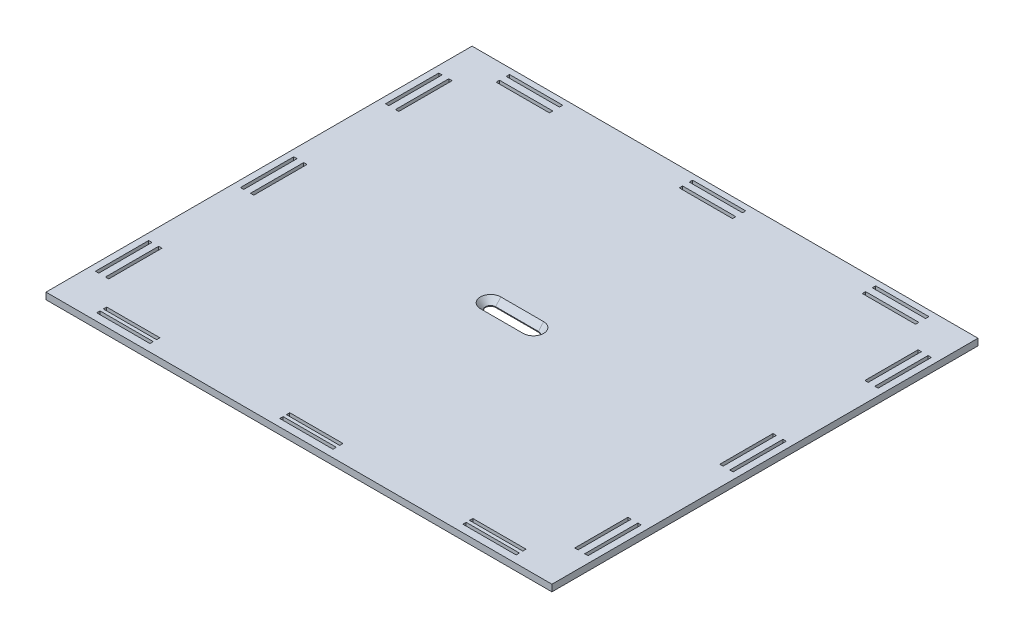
from build123d import *

# Parameters (mm, degrees)
SKETCH1_W           = 482.6
SKETCH1_H           = 406.4
BOSS_EXTRUDE1_DEPTH = 6.35
SKETCH2_W           = 482.6
SKETCH2_H           = 406.4
SKETCH2_W_2         = 476.25
SKETCH2_H_2         = 401.052631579
BOSS_EXTRUDE2_DEPTH = 3.175
SKETCH4_W           = 50.8
SKETCH4_H           = 3.175
CUT_EXTRUDE2_DEPTH  = 356.959166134
LPATTERN1_COUNT     = 3
LPATTERN1_PITCH     = 174.625
SKETCH7_W           = 3.175
SKETCH7_H           = 50.8
CUT_EXTRUDE3_DEPTH  = 356.959166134
LPATTERN2_COUNT     = 3
LPATTERN2_PITCH     = 138.363157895
SKETCH9_W           = 482.6
SKETCH9_H           = 406.4
SKETCH9_W_2         = 476.25
SKETCH9_H_2         = 401.052631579
CUT_EXTRUDE5_DEPTH  = 3.175
CUT_EXTRUDE6_DEPTH  = 356.959166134
CHAMFER2_SIZE       = 4.9149
CHAMFER2_SIZE2      = 5.653945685


with BuildPart() as part:
    # Sketch1 → Boss-Extrude1 (new body)
    with BuildSketch(Plane(origin=(0, 0, 0), x_dir=(1, 0, 0), z_dir=(0, 1, 0))):
        with Locations((32.403142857, 24.293285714)):
            Rectangle(SKETCH1_W, SKETCH1_H)
    extrude(amount=BOSS_EXTRUDE1_DEPTH)

    # Sketch2 → Boss-Extrude2 (add)
    with BuildSketch(Plane(origin=(0, 6.35, 0), x_dir=(1, 0, 0), z_dir=(0, 1, 0))):
        with Locations((32.403142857, 24.293285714)):
            Rectangle(SKETCH2_W, SKETCH2_H)
        with Locations((32.403142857, 24.293285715)):
            Rectangle(SKETCH2_W_2, SKETCH2_H_2, mode=Mode.SUBTRACT)
    extrude(amount=BOSS_EXTRUDE2_DEPTH)

    # Sketch4 → Cut-Extrude2 (cut, symmetric)
    with BuildSketch(Plane(origin=(0, 6.35, 0), x_dir=(1, 0, 0), z_dir=(0, 1, 0))):
        with Locations((-142.221857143, 220.341662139)):
            Rectangle(SKETCH4_W, SKETCH4_H)
        with Locations((-142.221857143, 210.816662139)):
            Rectangle(SKETCH4_W, SKETCH4_H)
        with Locations((-142.221857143, -163.892969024)):
            Rectangle(SKETCH4_W, SKETCH4_H)
        with Locations((-142.221857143, -170.242969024)):
            Rectangle(SKETCH4_W, SKETCH4_H)
    cut_extrude2 = extrude(amount=CUT_EXTRUDE2_DEPTH, both=True, mode=Mode.SUBTRACT)

    # LPattern1: Cut-Extrude2 ×3
    with Locations(*[(i * LPATTERN1_PITCH, 0, 0) for i in range(1, LPATTERN1_COUNT)]):
        add(cut_extrude2, mode=Mode.SUBTRACT)

    # Sketch7 → Cut-Extrude3 (cut, symmetric)
    with BuildSketch(Plane(origin=(0, 6.35, 0), x_dir=(1, 0, 0), z_dir=(0, 1, 0))):
        with Locations((-200.959357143, 163.993285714)):
            Rectangle(SKETCH7_W, SKETCH7_H)
        with Locations((-191.434357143, 163.993285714)):
            Rectangle(SKETCH7_W, SKETCH7_H)
        with Locations((256.240642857, 163.993285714)):
            Rectangle(SKETCH7_W, SKETCH7_H)
        with Locations((265.765642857, 163.993285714)):
            Rectangle(SKETCH7_W, SKETCH7_H)
    cut_extrude3 = extrude(amount=CUT_EXTRUDE3_DEPTH, both=True, mode=Mode.SUBTRACT)

    # LPattern2: Cut-Extrude3 ×3
    with Locations(*[(0, 0, i * LPATTERN2_PITCH) for i in range(1, LPATTERN2_COUNT)]):
        add(cut_extrude3, mode=Mode.SUBTRACT)

    # Sketch9 → Cut-Extrude5 (cut)
    with BuildSketch(Plane(origin=(0, 9.525, 0), x_dir=(1, 0, 0), z_dir=(0, 1, 0))):
        with Locations((32.403142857, 24.293285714)):
            Rectangle(SKETCH9_W, SKETCH9_H)
        with Locations((32.403142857, 24.293285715)):
            Rectangle(SKETCH9_W_2, SKETCH9_H_2, mode=Mode.SUBTRACT)
    extrude(amount=-CUT_EXTRUDE5_DEPTH, mode=Mode.SUBTRACT)

    # Sketch19 → Cut-Extrude6 (cut, through all)
    with BuildSketch(Plane(origin=(0, 6.35, 0), x_dir=(1, 0, 0), z_dir=(0, 1, 0))):
        with BuildLine():
            Line((11.983142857, 29.119285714), (52.823142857, 29.119285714))
            ThreePointArc((52.823142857, 29.119285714), (57.649142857, 24.293285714), (52.823142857, 19.467285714))
            Line((52.823142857, 19.467285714), (11.983142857, 19.467285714))
            ThreePointArc((11.983142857, 19.467285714), (7.157142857, 24.293285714), (11.983142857, 29.119285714))
        make_face()
    extrude(amount=-CUT_EXTRUDE6_DEPTH, mode=Mode.SUBTRACT)

    # Chamfer2
    chamfer2_edges = [part.edges().sort_by_distance(p)[0] for p in [
        (7.157142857, 6.35, -24.293285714),
        (32.403142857, 6.35, -19.467285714),
        (57.649142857, 6.35, -24.293285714),
        (32.403142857, 6.35, -29.119285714),
    ]]
    chamfer2_side = [part.faces().sort_by_distance(p)[0] for p in [
        (32.403142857, 6.35, 172.597485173),
    ]]
    chamfer(chamfer2_edges, length=CHAMFER2_SIZE, length2=CHAMFER2_SIZE2, reference=chamfer2_side[0])


solid = part.part
